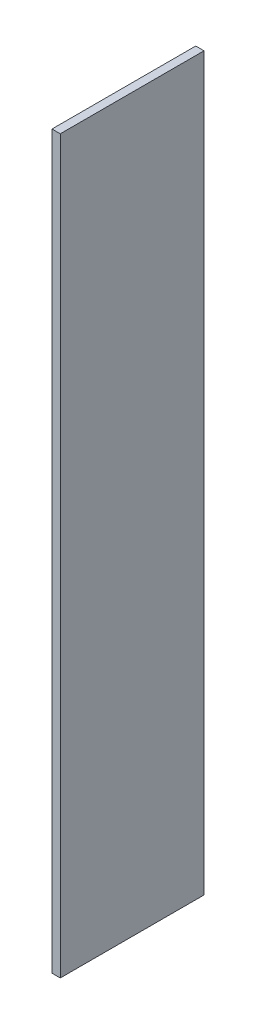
from build123d import *

# Parameters (mm, degrees)
SKETCH1_W           = 56.4388
SKETCH1_H           = 287.02
BOSS_EXTRUDE1_DEPTH = 3.2512


with BuildPart() as part:
    # Sketch1 → Boss-Extrude1 (new body)
    with BuildSketch(Plane(origin=(0, 0, 0), x_dir=(0, 0, -1), z_dir=(1, 0, 0))):
        Rectangle(SKETCH1_W, SKETCH1_H)
    extrude(amount=BOSS_EXTRUDE1_DEPTH)


solid = part.part
